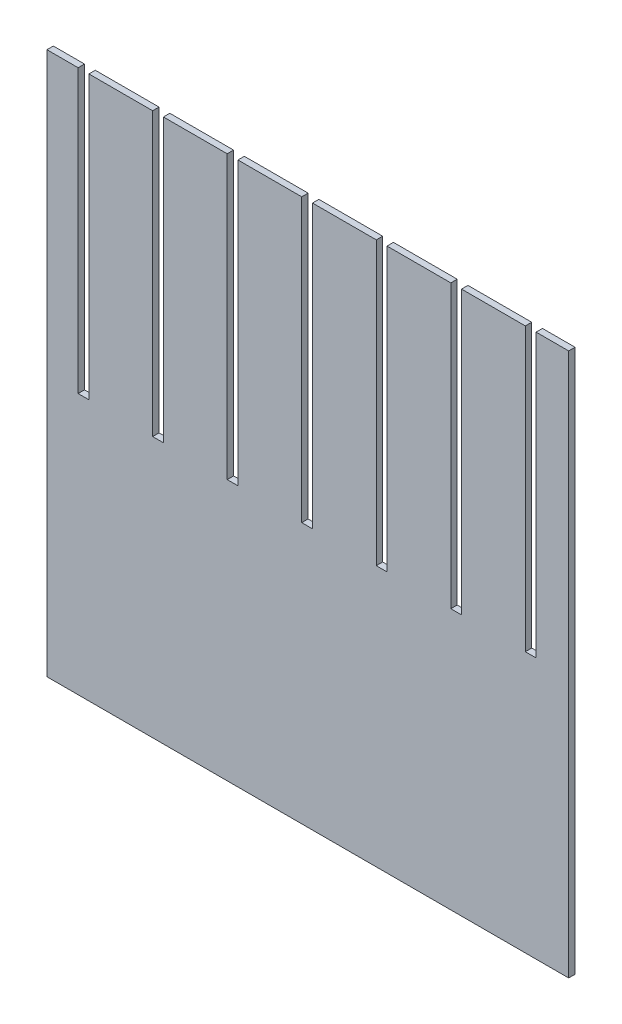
from build123d import *

# Parameters (mm, degrees)
SKETCH_1_W             = 49
SKETCH_1_H             = 51
EXTRUDE_1_DEPTH        = 0.6
SKETCH_3_W             = 1.01
SKETCH_3_H             = 26.5
CUT_EXTRUDE_1_DEPTH    = 53.659803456
PATTERN_LINEAR_1_COUNT = 7
PATTERN_LINEAR_1_PITCH = 7


with BuildPart() as part:
    # Sketch 1 → Extrude 1 (new body)
    with BuildSketch(Plane.XY):
        with Locations((21.57, 0)):
            Rectangle(SKETCH_1_W, SKETCH_1_H)
    extrude(amount=EXTRUDE_1_DEPTH)

    # Sketch 3 → Cut-Extrude 1 (cut, symmetric)
    with BuildSketch(Plane.XY):
        with Locations((0.505, 12.25)):
            Rectangle(SKETCH_3_W, SKETCH_3_H)
    cut_extrude_1 = extrude(amount=CUT_EXTRUDE_1_DEPTH, both=True, mode=Mode.SUBTRACT)

    # Pattern Linear 1: Cut-Extrude 1 ×7
    with Locations(*[(i * PATTERN_LINEAR_1_PITCH, 0, 0) for i in range(1, PATTERN_LINEAR_1_COUNT)]):
        add(cut_extrude_1, mode=Mode.SUBTRACT)


solid = part.part
